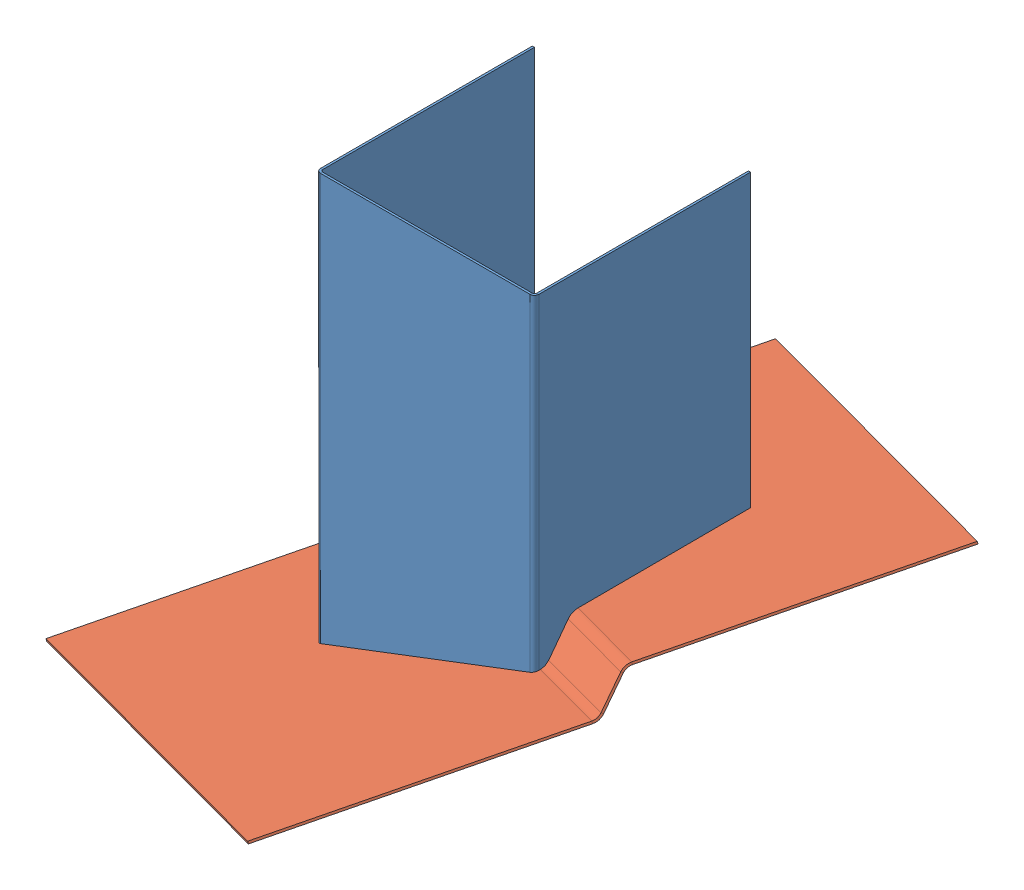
SolidWorks assembly Blechschnitt.SLDASM, configuration Standard (file format 4100). Lengths in mm.
Overall size (651.24 464.24 696.77).
2 component instances, 2 part files, 0 mates.
Components (placement in the parent):
- Teil1-1: Teil1.SLDPRT [Standard] at (343.7159 165.6136 -95.3491) size (204 382.12 202)
- Teil2-1: Teil2.SLDPRT [Standard] at (127.8622 270.5939 -273.3881) x (-0.424663 -0.16474 0.890237) z (-0.356309 0.934364 0.002939) size (526.75 500 32)
